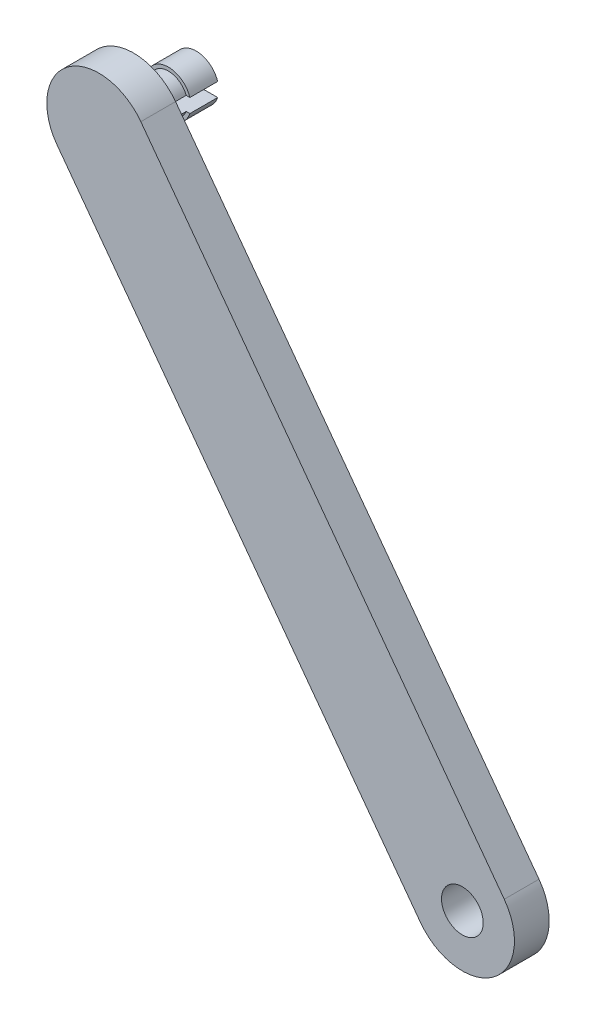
from build123d import *

# Parameters (mm, degrees)
BOSS_EXTRU_1_DEPTH      = 5
ESQUISSE2_R             = 3
ENL_V_MAT_EXTRU_1_DEPTH = 5
ESQUISSE3_R             = 2.75
BOSS_EXTRU_2_DEPTH      = 5
ESQUISSE4_R             = 3.25
BOSS_EXTRU_3_DEPTH      = 4
ESQUISSE5_W             = 10
ESQUISSE5_H             = 2
ENL_V_MAT_EXTRU_2_DEPTH = 9


with BuildPart() as part:
    # Esquisse1 → Boss.-Extru.1 (new body)
    with BuildSketch(Plane.XY):
        with BuildLine():
            Line((-6.031188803, -24.45811189), (-58.339701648, 46.307836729))
            ThreePointArc((-58.339701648, 46.307836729), (-56.766624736, 56.797137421), (-46.277324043, 55.224060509))
            Line((-46.277324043, 55.224060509), (6.031188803, -15.54188811))
            ThreePointArc((6.031188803, -15.54188811), (4.45811189, -26.031188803), (-6.031188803, -24.45811189))
        make_face()
    extrude(amount=BOSS_EXTRU_1_DEPTH)

    # Esquisse2 → Enl_v. mat.-Extru.1 (cut)
    with BuildSketch(Plane.XY.offset(5)):
        with Locations((0, -20)):
            Circle(ESQUISSE2_R)
    extrude(amount=-ENL_V_MAT_EXTRU_1_DEPTH, mode=Mode.SUBTRACT)

    # Esquisse3 → Boss.-Extru.2 (add)
    with BuildSketch(Plane(origin=(0, 0, 0), x_dir=(-1, 0, 0), z_dir=(0, 0, -1))):
        with Locations(Location((52.308512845, 50.765948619, 0), (0, 0, 180))):
            Circle(ESQUISSE3_R)
    extrude(amount=BOSS_EXTRU_2_DEPTH)

    # Esquisse4 → Boss.-Extru.3 (add)
    with BuildSketch(Plane(origin=(0, 0, -5), x_dir=(-1, 0, 0), z_dir=(0, 0, -1))):
        with Locations((52.308512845, 50.765948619)):
            Circle(ESQUISSE4_R)
    extrude(amount=BOSS_EXTRU_3_DEPTH)

    # Esquisse5 → Enl_v. mat.-Extru.2 (cut)
    with BuildSketch(Plane(origin=(0, 0, -9), x_dir=(-1, 0, 0), z_dir=(0, 0, -1))):
        with Locations((52.308512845, 50.765948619)):
            Rectangle(ESQUISSE5_W, ESQUISSE5_H)
    extrude(amount=-ENL_V_MAT_EXTRU_2_DEPTH, mode=Mode.SUBTRACT)


solid = part.part
